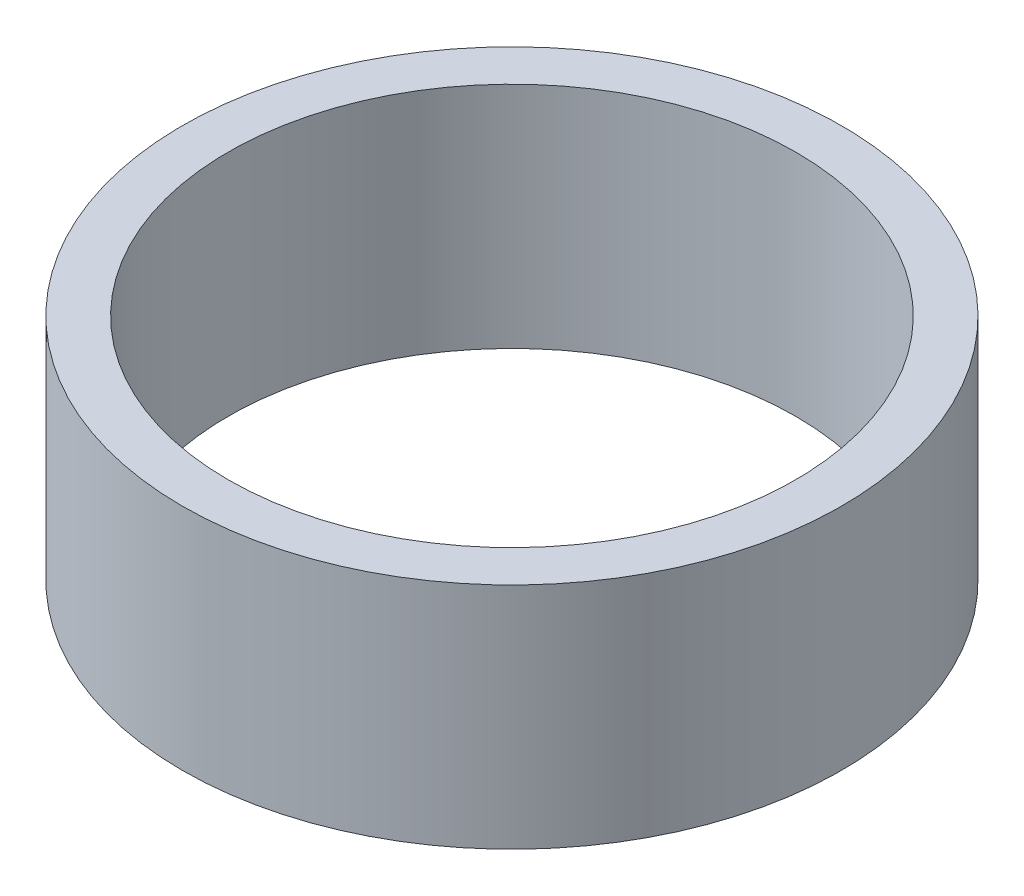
from build123d import *

# Parameters (mm, degrees)
ESQUISSE1_R        = 36
ESQUISSE1_R_2      = 31
BOSS_EXTRU_1_DEPTH = 25


with BuildPart() as part:
    # Esquisse1 → Boss.-Extru.1 (new body)
    with BuildSketch(Plane(origin=(0, 0, 0), x_dir=(1, 0, 0), z_dir=(0, 1, 0))):
        with Locations(Location((0, 0, 0), (0, 0, 270))):
            Circle(ESQUISSE1_R)
        with Locations(Location((0, 0, 0), (0, 0, 270))):
            Circle(ESQUISSE1_R_2, mode=Mode.SUBTRACT)
    extrude(amount=BOSS_EXTRU_1_DEPTH)


solid = part.part
